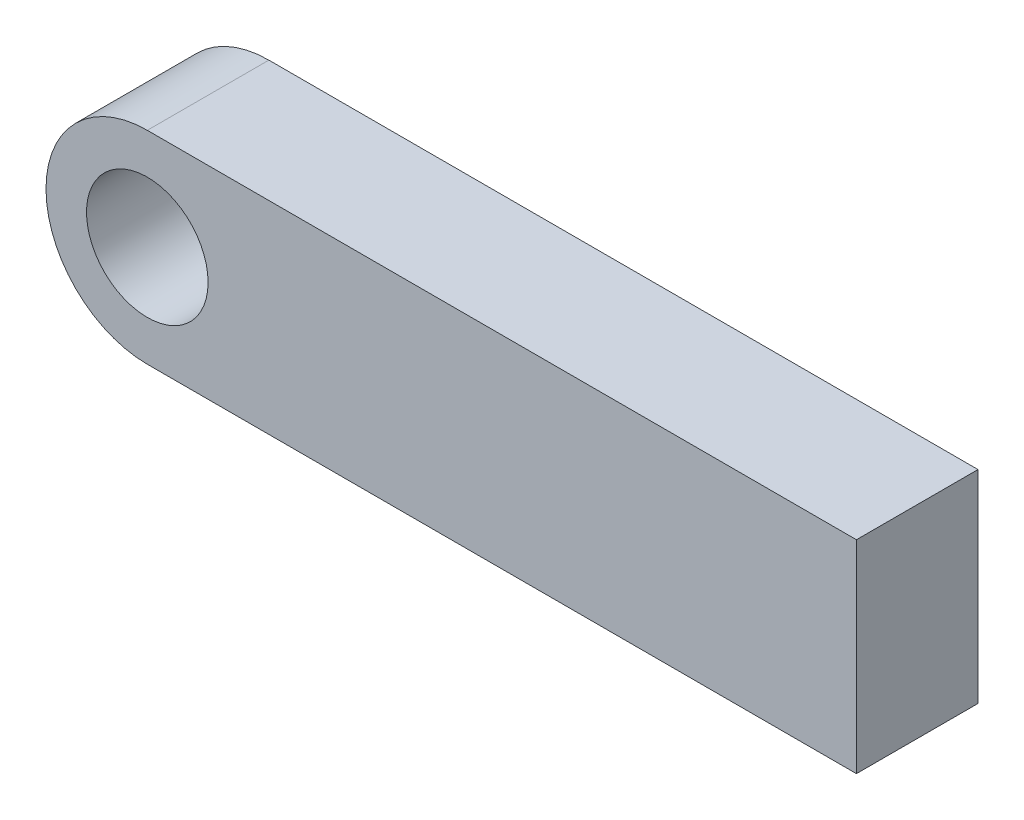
ISO-10303-21;
HEADER;
FILE_DESCRIPTION(('STEP AP214'),'2;1');
FILE_NAME('part.step','',(''),(''),'','','');
FILE_SCHEMA(('AUTOMOTIVE_DESIGN { 1 0 10303 214 1 1 1 1 }'));
ENDSEC;
DATA;
#1=APPLICATION_CONTEXT('core data for automotive mechanical design processes');
#2=APPLICATION_PROTOCOL_DEFINITION('international standard','automotive_design',2000,#1);
#3=PRODUCT_CONTEXT('',#1,'mechanical');
#4=PRODUCT('Part','Part','',(#3));
#5=PRODUCT_RELATED_PRODUCT_CATEGORY('part','',(#4));
#6=PRODUCT_DEFINITION_FORMATION('','',#4);
#7=PRODUCT_DEFINITION_CONTEXT('part definition',#1,'design');
#8=PRODUCT_DEFINITION('design','',#6,#7);
#9=PRODUCT_DEFINITION_SHAPE('','',#8);
#10=(LENGTH_UNIT() NAMED_UNIT(*) SI_UNIT(.MILLI.,.METRE.));
#11=(NAMED_UNIT(*) PLANE_ANGLE_UNIT() SI_UNIT($,.RADIAN.));
#12=(NAMED_UNIT(*) SI_UNIT($,.STERADIAN.) SOLID_ANGLE_UNIT());
#13=UNCERTAINTY_MEASURE_WITH_UNIT(LENGTH_MEASURE(1.E-05),#10,'distance_accuracy_value','');
#14=(GEOMETRIC_REPRESENTATION_CONTEXT(3) GLOBAL_UNCERTAINTY_ASSIGNED_CONTEXT((#13)) GLOBAL_UNIT_ASSIGNED_CONTEXT((#10,
#11,#12)) REPRESENTATION_CONTEXT('',''));
#15=CARTESIAN_POINT('',(0.,0.,0.));
#16=DIRECTION('',(0.,0.,1.));
#17=DIRECTION('',(1.,0.,0.));
#18=AXIS2_PLACEMENT_3D('',#15,#16,#17);
#19=CARTESIAN_POINT('',(0.,0.,3.));
#20=DIRECTION('',(0.,0.,-1.));
#21=DIRECTION('',(-1.,0.,0.));
#22=AXIS2_PLACEMENT_3D('',#19,#20,#21);
#23=PLANE('',#22);
#24=CARTESIAN_POINT('',(0.,0.,3.));
#25=DIRECTION('',(0.,0.,1.));
#26=DIRECTION('',(-1.,0.,0.));
#27=AXIS2_PLACEMENT_3D('',#24,#25,#26);
#28=CIRCLE('',#27,5.);
#29=CARTESIAN_POINT('',(0.,5.,3.));
#30=VERTEX_POINT('',#29);
#31=CARTESIAN_POINT('',(0.,-5.,3.));
#32=VERTEX_POINT('',#31);
#33=EDGE_CURVE('E102',#30,#32,#28,.T.);
#34=ORIENTED_EDGE('',*,*,#33,.T.);
#35=DIRECTION('',(1.,0.,0.));
#36=VECTOR('',#35,1.);
#37=CARTESIAN_POINT('',(0.,-5.,3.));
#38=LINE('',#37,#36);
#39=CARTESIAN_POINT('',(35.,-5.,3.));
#40=VERTEX_POINT('',#39);
#41=EDGE_CURVE('E87',#32,#40,#38,.T.);
#42=ORIENTED_EDGE('',*,*,#41,.T.);
#43=DIRECTION('',(0.,1.,0.));
#44=VECTOR('',#43,1.);
#45=CARTESIAN_POINT('',(35.,5.,3.));
#46=LINE('',#45,#44);
#47=CARTESIAN_POINT('',(35.,5.,3.));
#48=VERTEX_POINT('',#47);
#49=EDGE_CURVE('E53',#40,#48,#46,.T.);
#50=ORIENTED_EDGE('',*,*,#49,.T.);
#51=DIRECTION('',(-1.,0.,0.));
#52=VECTOR('',#51,1.);
#53=CARTESIAN_POINT('',(0.,5.,3.));
#54=LINE('',#53,#52);
#55=EDGE_CURVE('E48',#48,#30,#54,.T.);
#56=ORIENTED_EDGE('',*,*,#55,.T.);
#57=EDGE_LOOP('',(#34,#42,#50,#56));
#58=FACE_BOUND('',#57,.T.);
#59=CARTESIAN_POINT('',(0.,0.,3.));
#60=DIRECTION('',(0.,0.,1.));
#61=DIRECTION('',(1.,0.,0.));
#62=AXIS2_PLACEMENT_3D('',#59,#60,#61);
#63=CIRCLE('',#62,3.);
#64=CARTESIAN_POINT('',(3.,0.,3.));
#65=VERTEX_POINT('',#64);
#66=EDGE_CURVE('E92',#65,#65,#63,.T.);
#67=ORIENTED_EDGE('',*,*,#66,.F.);
#68=EDGE_LOOP('',(#67));
#69=FACE_BOUND('',#68,.T.);
#70=ADVANCED_FACE('F33',(#58,#69),#23,.F.);
#71=CARTESIAN_POINT('',(0.,0.,-3.));
#72=DIRECTION('',(0.,0.,-1.));
#73=DIRECTION('',(-1.,0.,0.));
#74=AXIS2_PLACEMENT_3D('',#71,#72,#73);
#75=PLANE('',#74);
#76=CARTESIAN_POINT('',(0.,0.,-3.));
#77=DIRECTION('',(0.,0.,1.));
#78=DIRECTION('',(-1.,0.,0.));
#79=AXIS2_PLACEMENT_3D('',#76,#77,#78);
#80=CIRCLE('',#79,5.);
#81=CARTESIAN_POINT('',(0.,5.,-3.));
#82=VERTEX_POINT('',#81);
#83=CARTESIAN_POINT('',(0.,-5.,-3.));
#84=VERTEX_POINT('',#83);
#85=EDGE_CURVE('E79',#82,#84,#80,.T.);
#86=ORIENTED_EDGE('',*,*,#85,.F.);
#87=DIRECTION('',(-1.,0.,0.));
#88=VECTOR('',#87,1.);
#89=CARTESIAN_POINT('',(0.,5.,-3.));
#90=LINE('',#89,#88);
#91=CARTESIAN_POINT('',(35.,5.,-3.));
#92=VERTEX_POINT('',#91);
#93=EDGE_CURVE('E100',#92,#82,#90,.T.);
#94=ORIENTED_EDGE('',*,*,#93,.F.);
#95=DIRECTION('',(0.,1.,0.));
#96=VECTOR('',#95,1.);
#97=CARTESIAN_POINT('',(35.,5.,-3.));
#98=LINE('',#97,#96);
#99=CARTESIAN_POINT('',(35.,-5.,-3.));
#100=VERTEX_POINT('',#99);
#101=EDGE_CURVE('E80',#100,#92,#98,.T.);
#102=ORIENTED_EDGE('',*,*,#101,.F.);
#103=DIRECTION('',(1.,0.,0.));
#104=VECTOR('',#103,1.);
#105=CARTESIAN_POINT('',(0.,-5.,-3.));
#106=LINE('',#105,#104);
#107=EDGE_CURVE('E74',#84,#100,#106,.T.);
#108=ORIENTED_EDGE('',*,*,#107,.F.);
#109=EDGE_LOOP('',(#86,#94,#102,#108));
#110=FACE_BOUND('',#109,.T.);
#111=CARTESIAN_POINT('',(0.,0.,-3.));
#112=DIRECTION('',(0.,0.,1.));
#113=DIRECTION('',(1.,0.,0.));
#114=AXIS2_PLACEMENT_3D('',#111,#112,#113);
#115=CIRCLE('',#114,3.);
#116=CARTESIAN_POINT('',(3.,0.,-3.));
#117=VERTEX_POINT('',#116);
#118=EDGE_CURVE('E95',#117,#117,#115,.T.);
#119=ORIENTED_EDGE('',*,*,#118,.T.);
#120=EDGE_LOOP('',(#119));
#121=FACE_BOUND('',#120,.T.);
#122=ADVANCED_FACE('F75',(#110,#121),#75,.T.);
#123=CARTESIAN_POINT('',(0.,0.,3.));
#124=DIRECTION('',(0.,0.,-1.));
#125=DIRECTION('',(-1.,0.,0.));
#126=AXIS2_PLACEMENT_3D('',#123,#124,#125);
#127=CYLINDRICAL_SURFACE('',#126,5.);
#128=ORIENTED_EDGE('',*,*,#85,.T.);
#129=DIRECTION('',(0.,0.,-1.));
#130=VECTOR('',#129,1.);
#131=CARTESIAN_POINT('',(0.,-5.,3.));
#132=LINE('',#131,#130);
#133=EDGE_CURVE('E11',#32,#84,#132,.T.);
#134=ORIENTED_EDGE('',*,*,#133,.F.);
#135=ORIENTED_EDGE('',*,*,#33,.F.);
#136=DIRECTION('',(0.,0.,-1.));
#137=VECTOR('',#136,1.);
#138=CARTESIAN_POINT('',(0.,5.,3.));
#139=LINE('',#138,#137);
#140=EDGE_CURVE('E91',#30,#82,#139,.T.);
#141=ORIENTED_EDGE('',*,*,#140,.T.);
#142=EDGE_LOOP('',(#128,#134,#135,#141));
#143=FACE_BOUND('',#142,.T.);
#144=ADVANCED_FACE('F35',(#143),#127,.T.);
#145=CARTESIAN_POINT('',(0.,-5.,3.));
#146=DIRECTION('',(0.,1.,0.));
#147=DIRECTION('',(0.,0.,1.));
#148=AXIS2_PLACEMENT_3D('',#145,#146,#147);
#149=PLANE('',#148);
#150=ORIENTED_EDGE('',*,*,#107,.T.);
#151=DIRECTION('',(0.,0.,-1.));
#152=VECTOR('',#151,1.);
#153=CARTESIAN_POINT('',(35.,-5.,3.));
#154=LINE('',#153,#152);
#155=EDGE_CURVE('E41',#40,#100,#154,.T.);
#156=ORIENTED_EDGE('',*,*,#155,.F.);
#157=ORIENTED_EDGE('',*,*,#41,.F.);
#158=ORIENTED_EDGE('',*,*,#133,.T.);
#159=EDGE_LOOP('',(#150,#156,#157,#158));
#160=FACE_BOUND('',#159,.T.);
#161=ADVANCED_FACE('F86',(#160),#149,.F.);
#162=CARTESIAN_POINT('',(35.,5.,3.));
#163=DIRECTION('',(-1.,0.,0.));
#164=DIRECTION('',(0.,0.,1.));
#165=AXIS2_PLACEMENT_3D('',#162,#163,#164);
#166=PLANE('',#165);
#167=ORIENTED_EDGE('',*,*,#101,.T.);
#168=DIRECTION('',(0.,0.,-1.));
#169=VECTOR('',#168,1.);
#170=CARTESIAN_POINT('',(35.,5.,3.));
#171=LINE('',#170,#169);
#172=EDGE_CURVE('E108',#48,#92,#171,.T.);
#173=ORIENTED_EDGE('',*,*,#172,.F.);
#174=ORIENTED_EDGE('',*,*,#49,.F.);
#175=ORIENTED_EDGE('',*,*,#155,.T.);
#176=EDGE_LOOP('',(#167,#173,#174,#175));
#177=FACE_BOUND('',#176,.T.);
#178=ADVANCED_FACE('F111',(#177),#166,.F.);
#179=CARTESIAN_POINT('',(0.,5.,3.));
#180=DIRECTION('',(0.,-1.,0.));
#181=DIRECTION('',(0.,0.,-1.));
#182=AXIS2_PLACEMENT_3D('',#179,#180,#181);
#183=PLANE('',#182);
#184=ORIENTED_EDGE('',*,*,#93,.T.);
#185=ORIENTED_EDGE('',*,*,#140,.F.);
#186=ORIENTED_EDGE('',*,*,#55,.F.);
#187=ORIENTED_EDGE('',*,*,#172,.T.);
#188=EDGE_LOOP('',(#184,#185,#186,#187));
#189=FACE_BOUND('',#188,.T.);
#190=ADVANCED_FACE('F113',(#189),#183,.F.);
#191=CARTESIAN_POINT('',(0.,0.,3.));
#192=DIRECTION('',(0.,0.,-1.));
#193=DIRECTION('',(-1.,0.,0.));
#194=AXIS2_PLACEMENT_3D('',#191,#192,#193);
#195=CYLINDRICAL_SURFACE('',#194,3.);
#196=ORIENTED_EDGE('',*,*,#66,.T.);
#197=EDGE_LOOP('',(#196));
#198=FACE_BOUND('',#197,.T.);
#199=ORIENTED_EDGE('',*,*,#118,.F.);
#200=EDGE_LOOP('',(#199));
#201=FACE_BOUND('',#200,.T.);
#202=ADVANCED_FACE('F119',(#198,#201),#195,.F.);
#203=CLOSED_SHELL('',(#70,#122,#144,#161,#178,#190,#202));
#204=MANIFOLD_SOLID_BREP('B2',#203);
#205=ADVANCED_BREP_SHAPE_REPRESENTATION('',(#18,#204),#14);
#206=SHAPE_DEFINITION_REPRESENTATION(#9,#205);
ENDSEC;
END-ISO-10303-21;
